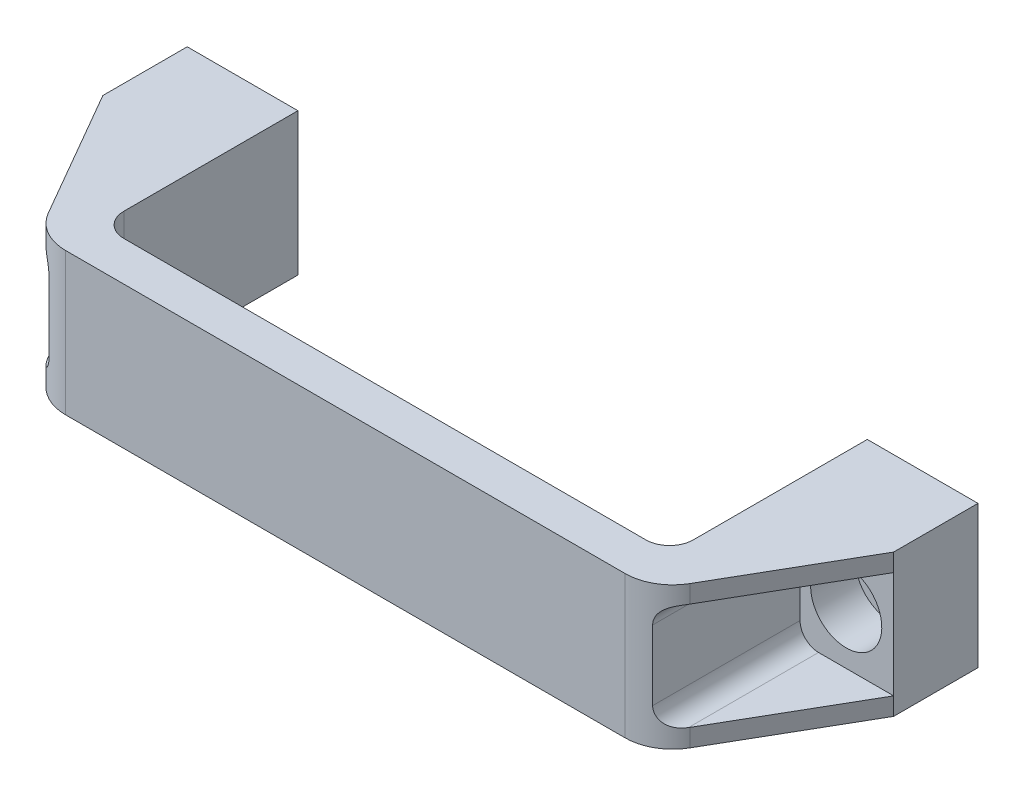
ISO-10303-21;
HEADER;
FILE_DESCRIPTION(('STEP AP214'),'2;1');
FILE_NAME('part.step','',(''),(''),'','','');
FILE_SCHEMA(('AUTOMOTIVE_DESIGN { 1 0 10303 214 1 1 1 1 }'));
ENDSEC;
DATA;
#1=APPLICATION_CONTEXT('core data for automotive mechanical design processes');
#2=APPLICATION_PROTOCOL_DEFINITION('international standard','automotive_design',2000,#1);
#3=PRODUCT_CONTEXT('',#1,'mechanical');
#4=PRODUCT('Part','Part','',(#3));
#5=PRODUCT_RELATED_PRODUCT_CATEGORY('part','',(#4));
#6=PRODUCT_DEFINITION_FORMATION('','',#4);
#7=PRODUCT_DEFINITION_CONTEXT('part definition',#1,'design');
#8=PRODUCT_DEFINITION('design','',#6,#7);
#9=PRODUCT_DEFINITION_SHAPE('','',#8);
#10=(LENGTH_UNIT() NAMED_UNIT(*) SI_UNIT(.MILLI.,.METRE.));
#11=(NAMED_UNIT(*) PLANE_ANGLE_UNIT() SI_UNIT($,.RADIAN.));
#12=(NAMED_UNIT(*) SI_UNIT($,.STERADIAN.) SOLID_ANGLE_UNIT());
#13=UNCERTAINTY_MEASURE_WITH_UNIT(LENGTH_MEASURE(1.E-05),#10,'distance_accuracy_value','');
#14=(GEOMETRIC_REPRESENTATION_CONTEXT(3) GLOBAL_UNCERTAINTY_ASSIGNED_CONTEXT((#13)) GLOBAL_UNIT_ASSIGNED_CONTEXT((#10,
#11,#12)) REPRESENTATION_CONTEXT('',''));
#15=CARTESIAN_POINT('',(0.,0.,0.));
#16=DIRECTION('',(0.,0.,1.));
#17=DIRECTION('',(1.,0.,0.));
#18=AXIS2_PLACEMENT_3D('',#15,#16,#17);
#19=CARTESIAN_POINT('',(0.,5.5,7.5));
#20=DIRECTION('',(0.,0.,-1.));
#21=DIRECTION('',(0.,1.,0.));
#22=AXIS2_PLACEMENT_3D('',#19,#20,#21);
#23=PLANE('',#22);
#24=CARTESIAN_POINT('',(0.,0.,7.5));
#25=DIRECTION('',(0.,0.,-1.));
#26=DIRECTION('',(0.,1.,0.));
#27=AXIS2_PLACEMENT_3D('',#24,#25,#26);
#28=CIRCLE('',#27,4.25);
#29=CARTESIAN_POINT('',(0.,4.25,7.5));
#30=VERTEX_POINT('',#29);
#31=EDGE_CURVE('E156',#30,#30,#28,.T.);
#32=ORIENTED_EDGE('',*,*,#31,.T.);
#33=EDGE_LOOP('',(#32));
#34=FACE_BOUND('',#33,.T.);
#35=CARTESIAN_POINT('',(0.,0.,7.5));
#36=DIRECTION('',(0.,0.,-1.));
#37=DIRECTION('',(0.,1.,0.));
#38=AXIS2_PLACEMENT_3D('',#35,#36,#37);
#39=CIRCLE('',#38,6.75);
#40=CARTESIAN_POINT('',(0.,6.75,7.5));
#41=VERTEX_POINT('',#40);
#42=EDGE_CURVE('E17',#41,#41,#39,.F.);
#43=ORIENTED_EDGE('',*,*,#42,.T.);
#44=EDGE_LOOP('',(#43));
#45=FACE_BOUND('',#44,.T.);
#46=ADVANCED_FACE('F14',(#34,#45),#23,.F.);
#47=CARTESIAN_POINT('',(132.,5.5,7.5));
#48=DIRECTION('',(0.,0.,-1.));
#49=DIRECTION('',(0.,1.,0.));
#50=AXIS2_PLACEMENT_3D('',#47,#48,#49);
#51=PLANE('',#50);
#52=CARTESIAN_POINT('',(132.,0.,7.5));
#53=DIRECTION('',(0.,0.,-1.));
#54=DIRECTION('',(0.,1.,0.));
#55=AXIS2_PLACEMENT_3D('',#52,#53,#54);
#56=CIRCLE('',#55,4.25);
#57=CARTESIAN_POINT('',(132.,4.25,7.5));
#58=VERTEX_POINT('',#57);
#59=EDGE_CURVE('E403',#58,#58,#56,.T.);
#60=ORIENTED_EDGE('',*,*,#59,.T.);
#61=EDGE_LOOP('',(#60));
#62=FACE_BOUND('',#61,.T.);
#63=CARTESIAN_POINT('',(132.,0.,7.5));
#64=DIRECTION('',(0.,0.,-1.));
#65=DIRECTION('',(0.,1.,0.));
#66=AXIS2_PLACEMENT_3D('',#63,#64,#65);
#67=CIRCLE('',#66,6.75);
#68=CARTESIAN_POINT('',(132.,6.75,7.5));
#69=VERTEX_POINT('',#68);
#70=EDGE_CURVE('E157',#69,#69,#67,.F.);
#71=ORIENTED_EDGE('',*,*,#70,.T.);
#72=EDGE_LOOP('',(#71));
#73=FACE_BOUND('',#72,.T.);
#74=ADVANCED_FACE('F421',(#62,#73),#51,.F.);
#75=CARTESIAN_POINT('',(0.,0.,11.75));
#76=DIRECTION('',(0.,0.,-1.));
#77=DIRECTION('',(0.,1.,0.));
#78=AXIS2_PLACEMENT_3D('',#75,#76,#77);
#79=CYLINDRICAL_SURFACE('',#78,6.75);
#80=CARTESIAN_POINT('',(0.,0.,16.));
#81=DIRECTION('',(0.,0.,-1.));
#82=DIRECTION('',(0.,1.,0.));
#83=AXIS2_PLACEMENT_3D('',#80,#81,#82);
#84=CIRCLE('',#83,6.75);
#85=CARTESIAN_POINT('',(0.,6.75,16.));
#86=VERTEX_POINT('',#85);
#87=EDGE_CURVE('E393',#86,#86,#84,.T.);
#88=ORIENTED_EDGE('',*,*,#87,.F.);
#89=EDGE_LOOP('',(#88));
#90=FACE_BOUND('',#89,.T.);
#91=ORIENTED_EDGE('',*,*,#42,.F.);
#92=EDGE_LOOP('',(#91));
#93=FACE_BOUND('',#92,.T.);
#94=ADVANCED_FACE('F418',(#90,#93),#79,.F.);
#95=CARTESIAN_POINT('',(132.,0.,11.75));
#96=DIRECTION('',(0.,0.,-1.));
#97=DIRECTION('',(0.,1.,0.));
#98=AXIS2_PLACEMENT_3D('',#95,#96,#97);
#99=CYLINDRICAL_SURFACE('',#98,6.75);
#100=CARTESIAN_POINT('',(132.,0.,16.));
#101=DIRECTION('',(0.,0.,-1.));
#102=DIRECTION('',(0.,1.,0.));
#103=AXIS2_PLACEMENT_3D('',#100,#101,#102);
#104=CIRCLE('',#103,6.75);
#105=CARTESIAN_POINT('',(132.,6.75,16.));
#106=VERTEX_POINT('',#105);
#107=EDGE_CURVE('E382',#106,#106,#104,.T.);
#108=ORIENTED_EDGE('',*,*,#107,.F.);
#109=EDGE_LOOP('',(#108));
#110=FACE_BOUND('',#109,.T.);
#111=ORIENTED_EDGE('',*,*,#70,.F.);
#112=EDGE_LOOP('',(#111));
#113=FACE_BOUND('',#112,.T.);
#114=ADVANCED_FACE('F420',(#110,#113),#99,.F.);
#115=CARTESIAN_POINT('',(-11.,10.125,16.));
#116=DIRECTION('',(0.,1.,0.));
#117=DIRECTION('',(-1.,0.,0.));
#118=AXIS2_PLACEMENT_3D('',#115,#116,#117);
#119=PLANE('',#118);
#120=DIRECTION('',(1.,0.,0.));
#121=VECTOR('',#120,1.);
#122=CARTESIAN_POINT('',(66.,10.125,16.));
#123=LINE('',#122,#121);
#124=CARTESIAN_POINT('',(5.25,10.125,16.));
#125=VERTEX_POINT('',#124);
#126=CARTESIAN_POINT('',(-9.,10.125,16.));
#127=VERTEX_POINT('',#126);
#128=EDGE_CURVE('E163',#125,#127,#123,.F.);
#129=ORIENTED_EDGE('',*,*,#128,.F.);
#130=DIRECTION('',(0.,0.,-1.));
#131=VECTOR('',#130,1.);
#132=CARTESIAN_POINT('',(5.25,10.125,16.));
#133=LINE('',#132,#131);
#134=CARTESIAN_POINT('',(5.25,10.125,40.6770191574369));
#135=VERTEX_POINT('',#134);
#136=EDGE_CURVE('E160',#125,#135,#133,.F.);
#137=ORIENTED_EDGE('',*,*,#136,.T.);
#138=CARTESIAN_POINT('',(12.9393102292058,10.125,36.));
#139=DIRECTION('',(0.,-1.,0.));
#140=DIRECTION('',(1.,0.,0.));
#141=AXIS2_PLACEMENT_3D('',#138,#139,#140);
#142=CIRCLE('',#141,9.);
#143=CARTESIAN_POINT('',(5.14508159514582,10.125,40.5));
#144=VERTEX_POINT('',#143);
#145=EDGE_CURVE('E144',#144,#135,#142,.F.);
#146=ORIENTED_EDGE('',*,*,#145,.F.);
#147=DIRECTION('',(-0.5,0.,-0.866025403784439));
#148=VECTOR('',#147,1.);
#149=CARTESIAN_POINT('',(5.1450815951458,10.125,40.5));
#150=LINE('',#149,#148);
#151=EDGE_CURVE('E378',#127,#144,#150,.F.);
#152=ORIENTED_EDGE('',*,*,#151,.F.);
#153=EDGE_LOOP('',(#129,#137,#146,#152));
#154=FACE_BOUND('',#153,.T.);
#155=ADVANCED_FACE('F161',(#154),#119,.F.);
#156=CARTESIAN_POINT('',(0.,0.,3.75));
#157=DIRECTION('',(0.,0.,-1.));
#158=DIRECTION('',(0.,1.,0.));
#159=AXIS2_PLACEMENT_3D('',#156,#157,#158);
#160=CYLINDRICAL_SURFACE('',#159,4.25);
#161=CARTESIAN_POINT('',(0.,0.,0.));
#162=DIRECTION('',(0.,0.,-1.));
#163=DIRECTION('',(0.,1.,0.));
#164=AXIS2_PLACEMENT_3D('',#161,#162,#163);
#165=CIRCLE('',#164,4.25);
#166=CARTESIAN_POINT('',(0.,4.25,0.));
#167=VERTEX_POINT('',#166);
#168=EDGE_CURVE('E347',#167,#167,#165,.F.);
#169=ORIENTED_EDGE('',*,*,#168,.F.);
#170=EDGE_LOOP('',(#169));
#171=FACE_BOUND('',#170,.T.);
#172=ORIENTED_EDGE('',*,*,#31,.F.);
#173=EDGE_LOOP('',(#172));
#174=FACE_BOUND('',#173,.T.);
#175=ADVANCED_FACE('F434',(#171,#174),#160,.F.);
#176=CARTESIAN_POINT('',(132.,0.,3.75));
#177=DIRECTION('',(0.,0.,-1.));
#178=DIRECTION('',(0.,1.,0.));
#179=AXIS2_PLACEMENT_3D('',#176,#177,#178);
#180=CYLINDRICAL_SURFACE('',#179,4.25);
#181=CARTESIAN_POINT('',(132.,0.,0.));
#182=DIRECTION('',(0.,0.,-1.));
#183=DIRECTION('',(0.,1.,0.));
#184=AXIS2_PLACEMENT_3D('',#181,#182,#183);
#185=CIRCLE('',#184,4.25);
#186=CARTESIAN_POINT('',(132.,4.25,0.));
#187=VERTEX_POINT('',#186);
#188=EDGE_CURVE('E333',#187,#187,#185,.F.);
#189=ORIENTED_EDGE('',*,*,#188,.F.);
#190=EDGE_LOOP('',(#189));
#191=FACE_BOUND('',#190,.T.);
#192=ORIENTED_EDGE('',*,*,#59,.F.);
#193=EDGE_LOOP('',(#192));
#194=FACE_BOUND('',#193,.T.);
#195=ADVANCED_FACE('F437',(#191,#194),#180,.F.);
#196=CARTESIAN_POINT('',(5.25,-10.125,16.));
#197=DIRECTION('',(0.,-1.,0.));
#198=DIRECTION('',(1.,0.,0.));
#199=AXIS2_PLACEMENT_3D('',#196,#197,#198);
#200=PLANE('',#199);
#201=DIRECTION('',(0.,0.,-1.));
#202=VECTOR('',#201,1.);
#203=CARTESIAN_POINT('',(5.25,-10.125,16.));
#204=LINE('',#203,#202);
#205=CARTESIAN_POINT('',(5.25,-10.125,40.6770191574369));
#206=VERTEX_POINT('',#205);
#207=CARTESIAN_POINT('',(5.25,-10.125,16.));
#208=VERTEX_POINT('',#207);
#209=EDGE_CURVE('E357',#206,#208,#204,.T.);
#210=ORIENTED_EDGE('',*,*,#209,.T.);
#211=DIRECTION('',(1.,0.,0.));
#212=VECTOR('',#211,1.);
#213=CARTESIAN_POINT('',(66.,-10.125,16.));
#214=LINE('',#213,#212);
#215=CARTESIAN_POINT('',(-9.,-10.125,16.));
#216=VERTEX_POINT('',#215);
#217=EDGE_CURVE('E391',#216,#208,#214,.T.);
#218=ORIENTED_EDGE('',*,*,#217,.F.);
#219=DIRECTION('',(-0.5,0.,-0.866025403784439));
#220=VECTOR('',#219,1.);
#221=CARTESIAN_POINT('',(5.1450815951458,-10.125,40.5));
#222=LINE('',#221,#220);
#223=CARTESIAN_POINT('',(5.14508159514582,-10.125,40.5));
#224=VERTEX_POINT('',#223);
#225=EDGE_CURVE('E325',#224,#216,#222,.T.);
#226=ORIENTED_EDGE('',*,*,#225,.F.);
#227=CARTESIAN_POINT('',(12.9393102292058,-10.125,36.));
#228=DIRECTION('',(0.,-1.,0.));
#229=DIRECTION('',(1.,0.,0.));
#230=AXIS2_PLACEMENT_3D('',#227,#228,#229);
#231=CIRCLE('',#230,9.);
#232=EDGE_CURVE('E399',#206,#224,#231,.T.);
#233=ORIENTED_EDGE('',*,*,#232,.F.);
#234=EDGE_LOOP('',(#210,#218,#226,#233));
#235=FACE_BOUND('',#234,.T.);
#236=ADVANCED_FACE('F441',(#235),#200,.F.);
#237=CARTESIAN_POINT('',(66.,0.,16.));
#238=DIRECTION('',(0.,0.,1.));
#239=DIRECTION('',(0.,-1.,0.));
#240=AXIS2_PLACEMENT_3D('',#237,#238,#239);
#241=PLANE('',#240);
#242=CARTESIAN_POINT('',(5.25,6.625,16.));
#243=DIRECTION('',(0.,0.,-1.));
#244=DIRECTION('',(0.,1.,0.));
#245=AXIS2_PLACEMENT_3D('',#242,#243,#244);
#246=CIRCLE('',#245,3.5);
#247=CARTESIAN_POINT('',(8.75,6.625,16.));
#248=VERTEX_POINT('',#247);
#249=EDGE_CURVE('E168',#248,#125,#246,.F.);
#250=ORIENTED_EDGE('',*,*,#249,.T.);
#251=ORIENTED_EDGE('',*,*,#128,.T.);
#252=DIRECTION('',(0.,-1.,0.));
#253=VECTOR('',#252,1.);
#254=CARTESIAN_POINT('',(-9.,-13.5,16.));
#255=LINE('',#254,#253);
#256=EDGE_CURVE('E310',#216,#127,#255,.F.);
#257=ORIENTED_EDGE('',*,*,#256,.F.);
#258=ORIENTED_EDGE('',*,*,#217,.T.);
#259=CARTESIAN_POINT('',(5.25,-6.625,16.));
#260=DIRECTION('',(0.,0.,-1.));
#261=DIRECTION('',(0.,1.,0.));
#262=AXIS2_PLACEMENT_3D('',#259,#260,#261);
#263=CIRCLE('',#262,3.5);
#264=CARTESIAN_POINT('',(8.75,-6.625,16.));
#265=VERTEX_POINT('',#264);
#266=EDGE_CURVE('E356',#208,#265,#263,.F.);
#267=ORIENTED_EDGE('',*,*,#266,.T.);
#268=DIRECTION('',(0.,1.,0.));
#269=VECTOR('',#268,1.);
#270=CARTESIAN_POINT('',(8.75,6.625,16.));
#271=LINE('',#270,#269);
#272=EDGE_CURVE('E167',#265,#248,#271,.T.);
#273=ORIENTED_EDGE('',*,*,#272,.T.);
#274=EDGE_LOOP('',(#250,#251,#257,#258,#267,#273));
#275=FACE_BOUND('',#274,.T.);
#276=ORIENTED_EDGE('',*,*,#87,.T.);
#277=EDGE_LOOP('',(#276));
#278=FACE_BOUND('',#277,.T.);
#279=ADVANCED_FACE('F445',(#275,#278),#241,.T.);
#280=CARTESIAN_POINT('',(143.,-10.125,16.));
#281=DIRECTION('',(0.,-1.,0.));
#282=DIRECTION('',(1.,0.,0.));
#283=AXIS2_PLACEMENT_3D('',#280,#281,#282);
#284=PLANE('',#283);
#285=DIRECTION('',(-0.5,0.,0.866025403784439));
#286=VECTOR('',#285,1.);
#287=CARTESIAN_POINT('',(141.,-10.125,16.));
#288=LINE('',#287,#286);
#289=CARTESIAN_POINT('',(141.,-10.125,16.));
#290=VERTEX_POINT('',#289);
#291=CARTESIAN_POINT('',(126.854918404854,-10.125,40.5));
#292=VERTEX_POINT('',#291);
#293=EDGE_CURVE('E316',#290,#292,#288,.T.);
#294=ORIENTED_EDGE('',*,*,#293,.F.);
#295=DIRECTION('',(1.,0.,0.));
#296=VECTOR('',#295,1.);
#297=CARTESIAN_POINT('',(66.,-10.125,16.));
#298=LINE('',#297,#296);
#299=CARTESIAN_POINT('',(126.75,-10.125,16.));
#300=VERTEX_POINT('',#299);
#301=EDGE_CURVE('E375',#300,#290,#298,.T.);
#302=ORIENTED_EDGE('',*,*,#301,.F.);
#303=DIRECTION('',(0.,0.,-1.));
#304=VECTOR('',#303,1.);
#305=CARTESIAN_POINT('',(126.75,-10.125,16.));
#306=LINE('',#305,#304);
#307=CARTESIAN_POINT('',(126.75,-10.125,40.6770191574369));
#308=VERTEX_POINT('',#307);
#309=EDGE_CURVE('E287',#300,#308,#306,.F.);
#310=ORIENTED_EDGE('',*,*,#309,.T.);
#311=CARTESIAN_POINT('',(119.060689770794,-10.125,36.));
#312=DIRECTION('',(0.,-1.,0.));
#313=DIRECTION('',(1.,0.,0.));
#314=AXIS2_PLACEMENT_3D('',#311,#312,#313);
#315=CIRCLE('',#314,9.);
#316=EDGE_CURVE('E390',#292,#308,#315,.T.);
#317=ORIENTED_EDGE('',*,*,#316,.F.);
#318=EDGE_LOOP('',(#294,#302,#310,#317));
#319=FACE_BOUND('',#318,.T.);
#320=ADVANCED_FACE('F449',(#319),#284,.F.);
#321=CARTESIAN_POINT('',(126.75,10.125,16.));
#322=DIRECTION('',(0.,1.,0.));
#323=DIRECTION('',(-1.,0.,0.));
#324=AXIS2_PLACEMENT_3D('',#321,#322,#323);
#325=PLANE('',#324);
#326=DIRECTION('',(0.,0.,-1.));
#327=VECTOR('',#326,1.);
#328=CARTESIAN_POINT('',(126.75,10.125,16.));
#329=LINE('',#328,#327);
#330=CARTESIAN_POINT('',(126.75,10.125,40.6770191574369));
#331=VERTEX_POINT('',#330);
#332=CARTESIAN_POINT('',(126.75,10.125,16.));
#333=VERTEX_POINT('',#332);
#334=EDGE_CURVE('E281',#331,#333,#329,.T.);
#335=ORIENTED_EDGE('',*,*,#334,.T.);
#336=DIRECTION('',(1.,0.,0.));
#337=VECTOR('',#336,1.);
#338=CARTESIAN_POINT('',(66.,10.125,16.));
#339=LINE('',#338,#337);
#340=CARTESIAN_POINT('',(141.,10.125,16.));
#341=VERTEX_POINT('',#340);
#342=EDGE_CURVE('E379',#341,#333,#339,.F.);
#343=ORIENTED_EDGE('',*,*,#342,.F.);
#344=DIRECTION('',(-0.5,0.,0.866025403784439));
#345=VECTOR('',#344,1.);
#346=CARTESIAN_POINT('',(141.,10.125,16.));
#347=LINE('',#346,#345);
#348=CARTESIAN_POINT('',(126.854918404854,10.125,40.5));
#349=VERTEX_POINT('',#348);
#350=EDGE_CURVE('E299',#349,#341,#347,.F.);
#351=ORIENTED_EDGE('',*,*,#350,.F.);
#352=CARTESIAN_POINT('',(119.060689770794,10.125,36.));
#353=DIRECTION('',(0.,-1.,0.));
#354=DIRECTION('',(1.,0.,0.));
#355=AXIS2_PLACEMENT_3D('',#352,#353,#354);
#356=CIRCLE('',#355,9.);
#357=EDGE_CURVE('E548',#331,#349,#356,.F.);
#358=ORIENTED_EDGE('',*,*,#357,.F.);
#359=EDGE_LOOP('',(#335,#343,#351,#358));
#360=FACE_BOUND('',#359,.T.);
#361=ADVANCED_FACE('F452',(#360),#325,.F.);
#362=CARTESIAN_POINT('',(66.,0.,16.));
#363=DIRECTION('',(0.,0.,1.));
#364=DIRECTION('',(0.,-1.,0.));
#365=AXIS2_PLACEMENT_3D('',#362,#363,#364);
#366=PLANE('',#365);
#367=CARTESIAN_POINT('',(126.75,-6.625,16.));
#368=DIRECTION('',(0.,0.,-1.));
#369=DIRECTION('',(0.,1.,0.));
#370=AXIS2_PLACEMENT_3D('',#367,#368,#369);
#371=CIRCLE('',#370,3.5);
#372=CARTESIAN_POINT('',(123.25,-6.625,16.));
#373=VERTEX_POINT('',#372);
#374=EDGE_CURVE('E290',#373,#300,#371,.F.);
#375=ORIENTED_EDGE('',*,*,#374,.T.);
#376=ORIENTED_EDGE('',*,*,#301,.T.);
#377=DIRECTION('',(0.,1.,0.));
#378=VECTOR('',#377,1.);
#379=CARTESIAN_POINT('',(141.,-13.5,16.));
#380=LINE('',#379,#378);
#381=EDGE_CURVE('E326',#341,#290,#380,.F.);
#382=ORIENTED_EDGE('',*,*,#381,.F.);
#383=ORIENTED_EDGE('',*,*,#342,.T.);
#384=CARTESIAN_POINT('',(126.75,6.625,16.));
#385=DIRECTION('',(0.,0.,-1.));
#386=DIRECTION('',(0.,1.,0.));
#387=AXIS2_PLACEMENT_3D('',#384,#385,#386);
#388=CIRCLE('',#387,3.5);
#389=CARTESIAN_POINT('',(123.25,6.625,16.));
#390=VERTEX_POINT('',#389);
#391=EDGE_CURVE('E280',#333,#390,#388,.F.);
#392=ORIENTED_EDGE('',*,*,#391,.T.);
#393=DIRECTION('',(0.,-1.,0.));
#394=VECTOR('',#393,1.);
#395=CARTESIAN_POINT('',(123.25,-6.625,16.));
#396=LINE('',#395,#394);
#397=EDGE_CURVE('E286',#390,#373,#396,.T.);
#398=ORIENTED_EDGE('',*,*,#397,.T.);
#399=EDGE_LOOP('',(#375,#376,#382,#383,#392,#398));
#400=FACE_BOUND('',#399,.T.);
#401=ORIENTED_EDGE('',*,*,#107,.T.);
#402=EDGE_LOOP('',(#401));
#403=FACE_BOUND('',#402,.T.);
#404=ADVANCED_FACE('F456',(#400,#403),#366,.T.);
#405=CARTESIAN_POINT('',(5.1450815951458,-13.5,40.5));
#406=DIRECTION('',(-0.866025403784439,0.,0.5));
#407=DIRECTION('',(-0.5,0.,-0.866025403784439));
#408=AXIS2_PLACEMENT_3D('',#405,#406,#407);
#409=PLANE('',#408);
#410=DIRECTION('',(-0.5,0.,-0.866025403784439));
#411=VECTOR('',#410,1.);
#412=CARTESIAN_POINT('',(5.1450815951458,13.5,40.5));
#413=LINE('',#412,#411);
#414=CARTESIAN_POINT('',(5.14508159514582,13.5,40.5));
#415=VERTEX_POINT('',#414);
#416=CARTESIAN_POINT('',(-9.,13.5,16.));
#417=VERTEX_POINT('',#416);
#418=EDGE_CURVE('E262',#415,#417,#413,.T.);
#419=ORIENTED_EDGE('',*,*,#418,.T.);
#420=DIRECTION('',(0.,-1.,0.));
#421=VECTOR('',#420,1.);
#422=CARTESIAN_POINT('',(-9.,-13.5,16.));
#423=LINE('',#422,#421);
#424=EDGE_CURVE('E303',#127,#417,#423,.F.);
#425=ORIENTED_EDGE('',*,*,#424,.F.);
#426=ORIENTED_EDGE('',*,*,#151,.T.);
#427=DIRECTION('',(0.,-1.,0.));
#428=VECTOR('',#427,1.);
#429=CARTESIAN_POINT('',(5.14508159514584,-13.5,40.5));
#430=LINE('',#429,#428);
#431=EDGE_CURVE('E155',#415,#144,#430,.T.);
#432=ORIENTED_EDGE('',*,*,#431,.F.);
#433=EDGE_LOOP('',(#419,#425,#426,#432));
#434=FACE_BOUND('',#433,.T.);
#435=ADVANCED_FACE('F459',(#434),#409,.T.);
#436=CARTESIAN_POINT('',(5.25,6.625,16.));
#437=DIRECTION('',(0.,0.,-1.));
#438=DIRECTION('',(0.,1.,0.));
#439=AXIS2_PLACEMENT_3D('',#436,#437,#438);
#440=CYLINDRICAL_SURFACE('',#439,3.5);
#441=ORIENTED_EDGE('',*,*,#136,.F.);
#442=ORIENTED_EDGE('',*,*,#249,.F.);
#443=DIRECTION('',(0.,0.,1.));
#444=VECTOR('',#443,1.);
#445=CARTESIAN_POINT('',(8.75,6.625,16.));
#446=LINE('',#445,#444);
#447=CARTESIAN_POINT('',(8.75,6.625,43.9655307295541));
#448=VERTEX_POINT('',#447);
#449=EDGE_CURVE('E172',#248,#448,#446,.T.);
#450=ORIENTED_EDGE('',*,*,#449,.T.);
#451=CARTESIAN_POINT('',(5.25,10.125,40.6770191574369));
#452=CARTESIAN_POINT('',(5.3262495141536,10.1249844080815,40.8024080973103));
#453=CARTESIAN_POINT('',(5.40562218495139,10.1225060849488,40.925965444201));
#454=CARTESIAN_POINT('',(5.57029393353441,10.1112968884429,41.169053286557));
#455=CARTESIAN_POINT('',(5.65560238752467,10.1025559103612,41.2885769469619));
#456=CARTESIAN_POINT('',(5.83244272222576,10.0773623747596,41.5239779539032));
#457=CARTESIAN_POINT('',(5.92402761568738,10.0608347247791,41.6398078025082));
#458=CARTESIAN_POINT('',(6.1118645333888,10.0185895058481,41.8657940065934));
#459=CARTESIAN_POINT('',(6.20811344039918,9.99287800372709,41.9759540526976));
#460=CARTESIAN_POINT('',(6.38283068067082,9.93757546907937,42.1664779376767));
#461=CARTESIAN_POINT('',(6.46059086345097,9.91005843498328,42.2480944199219));
#462=CARTESIAN_POINT('',(6.61766220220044,9.84782994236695,42.4069675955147));
#463=CARTESIAN_POINT('',(6.69697299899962,9.81312013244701,42.4842252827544));
#464=CARTESIAN_POINT('',(6.85603775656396,9.736016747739,42.6336764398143));
#465=CARTESIAN_POINT('',(6.9357890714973,9.69365146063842,42.7058872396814));
#466=CARTESIAN_POINT('',(7.09501448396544,9.60063726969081,42.8450992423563));
#467=CARTESIAN_POINT('',(7.1744886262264,9.54998977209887,42.9121013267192));
#468=CARTESIAN_POINT('',(7.32037244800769,9.44816517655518,43.0310060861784));
#469=CARTESIAN_POINT('',(7.38697979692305,9.39816851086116,43.0836780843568));
#470=CARTESIAN_POINT('',(7.51833998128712,9.29179083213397,43.1847020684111));
#471=CARTESIAN_POINT('',(7.58309313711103,9.23541093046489,43.233054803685));
#472=CARTESIAN_POINT('',(7.70993731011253,9.11624165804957,43.3252859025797));
#473=CARTESIAN_POINT('',(7.7720266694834,9.05344837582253,43.3691615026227));
#474=CARTESIAN_POINT('',(7.8925911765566,8.92166776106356,43.4522470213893));
#475=CARTESIAN_POINT('',(7.95106792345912,8.85268320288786,43.4914590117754));
#476=CARTESIAN_POINT('',(8.06382628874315,8.70845840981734,43.5653303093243));
#477=CARTESIAN_POINT('',(8.11808686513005,8.633190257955,43.5999673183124));
#478=CARTESIAN_POINT('',(8.22125790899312,8.47712742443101,43.6644429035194));
#479=CARTESIAN_POINT('',(8.27016834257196,8.39633270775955,43.6942814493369));
#480=CARTESIAN_POINT('',(8.36186774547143,8.22977946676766,43.7491856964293));
#481=CARTESIAN_POINT('',(8.40465591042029,8.14402029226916,43.7742507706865));
#482=CARTESIAN_POINT('',(8.48341955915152,7.9682326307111,43.8196615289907));
#483=CARTESIAN_POINT('',(8.51939537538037,7.87820435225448,43.8400074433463));
#484=CARTESIAN_POINT('',(8.58399463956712,7.69456130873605,43.8760776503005));
#485=CARTESIAN_POINT('',(8.61261183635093,7.60094357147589,43.8917980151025));
#486=CARTESIAN_POINT('',(8.66200842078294,7.41102134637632,43.9186789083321));
#487=CARTESIAN_POINT('',(8.68278768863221,7.31471681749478,43.9298393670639));
#488=CARTESIAN_POINT('',(8.71623315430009,7.11998206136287,43.9477042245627));
#489=CARTESIAN_POINT('',(8.72887320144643,7.02154602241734,43.9543942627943));
#490=CARTESIAN_POINT('',(8.74576893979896,6.82374131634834,43.9633049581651));
#491=CARTESIAN_POINT('',(8.75002330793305,6.72437250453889,43.9655249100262));
#492=CARTESIAN_POINT('',(8.75,6.625,43.9655307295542));
#493=B_SPLINE_CURVE_WITH_KNOTS('',3,(#451,#452,#453,#454,#455,#456,#457,#458,#459,#460,#461,
#462,#463,#464,#465,#466,#467,#468,#469,#470,#471,#472,#473,#474,#475,#476,#477,#478,#479,#480,
#481,#482,#483,#484,#485,#486,#487,#488,#489,#490,#491,#492),.UNSPECIFIED.,.F.,.F.,(4,2,2,2,2,2,
2,2,2,2,2,2,2,2,2,2,2,2,2,2,4),(0.,0.440281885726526,0.881275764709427,1.32661234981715,
1.77165528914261,2.11949179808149,2.46724867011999,2.81374589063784,3.1601843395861,
3.45551378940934,3.75079189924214,4.04625118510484,4.34157872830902,4.63829637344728,
4.93501589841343,5.23177437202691,5.52851835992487,5.82551360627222,6.12251339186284,
6.42046271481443,6.71845904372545),.UNSPECIFIED.);
#494=EDGE_CURVE('E152',#135,#448,#493,.T.);
#495=ORIENTED_EDGE('',*,*,#494,.F.);
#496=EDGE_LOOP('',(#441,#442,#450,#495));
#497=FACE_BOUND('',#496,.T.);
#498=ADVANCED_FACE('F170',(#497),#440,.F.);
#499=CARTESIAN_POINT('',(8.75,6.625,16.));
#500=DIRECTION('',(1.,0.,0.));
#501=DIRECTION('',(0.,1.,0.));
#502=AXIS2_PLACEMENT_3D('',#499,#500,#501);
#503=PLANE('',#502);
#504=ORIENTED_EDGE('',*,*,#449,.F.);
#505=ORIENTED_EDGE('',*,*,#272,.F.);
#506=DIRECTION('',(0.,0.,-1.));
#507=VECTOR('',#506,1.);
#508=CARTESIAN_POINT('',(8.75,-6.625,16.));
#509=LINE('',#508,#507);
#510=CARTESIAN_POINT('',(8.75,-6.625,43.9655307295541));
#511=VERTEX_POINT('',#510);
#512=EDGE_CURVE('E354',#265,#511,#509,.F.);
#513=ORIENTED_EDGE('',*,*,#512,.T.);
#514=DIRECTION('',(0.,-1.,0.));
#515=VECTOR('',#514,1.);
#516=CARTESIAN_POINT('',(8.75,-13.5,43.9655307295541));
#517=LINE('',#516,#515);
#518=EDGE_CURVE('E174',#448,#511,#517,.T.);
#519=ORIENTED_EDGE('',*,*,#518,.F.);
#520=EDGE_LOOP('',(#504,#505,#513,#519));
#521=FACE_BOUND('',#520,.T.);
#522=ADVANCED_FACE('F466',(#521),#503,.F.);
#523=CARTESIAN_POINT('',(5.25,-6.625,16.));
#524=DIRECTION('',(0.,0.,-1.));
#525=DIRECTION('',(0.,1.,0.));
#526=AXIS2_PLACEMENT_3D('',#523,#524,#525);
#527=CYLINDRICAL_SURFACE('',#526,3.5);
#528=ORIENTED_EDGE('',*,*,#512,.F.);
#529=ORIENTED_EDGE('',*,*,#266,.F.);
#530=ORIENTED_EDGE('',*,*,#209,.F.);
#531=CARTESIAN_POINT('',(8.75,-6.625,43.9655307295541));
#532=CARTESIAN_POINT('',(8.75001434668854,-6.71304287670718,43.9655270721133));
#533=CARTESIAN_POINT('',(8.74667851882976,-6.80108371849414,43.9637835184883));
#534=CARTESIAN_POINT('',(8.73341000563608,-6.9765185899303,43.9567900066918));
#535=CARTESIAN_POINT('',(8.72347794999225,-7.06391268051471,43.9515403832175));
#536=CARTESIAN_POINT('',(8.6971440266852,-7.23727305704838,43.9375206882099));
#537=CARTESIAN_POINT('',(8.68075377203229,-7.32324161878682,43.9287569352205));
#538=CARTESIAN_POINT('',(8.64170627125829,-7.49329563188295,43.9076605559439));
#539=CARTESIAN_POINT('',(8.61904907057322,-7.57738109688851,43.8953279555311));
#540=CARTESIAN_POINT('',(8.56774054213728,-7.74308857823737,43.8670347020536));
#541=CARTESIAN_POINT('',(8.53908838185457,-7.82471025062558,43.8510735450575));
#542=CARTESIAN_POINT('',(8.47613617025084,-7.984947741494,43.8154580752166));
#543=CARTESIAN_POINT('',(8.44183404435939,-8.06356244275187,43.7958024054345));
#544=CARTESIAN_POINT('',(8.36803851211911,-8.21719791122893,43.7527605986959));
#545=CARTESIAN_POINT('',(8.32854787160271,-8.29222056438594,43.729376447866));
#546=CARTESIAN_POINT('',(8.24484339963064,-8.43828492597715,43.6788262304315));
#547=CARTESIAN_POINT('',(8.20062781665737,-8.50932514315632,43.651658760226));
#548=CARTESIAN_POINT('',(8.10746245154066,-8.64785906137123,43.5931748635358));
#549=CARTESIAN_POINT('',(8.05846094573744,-8.71529812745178,43.5618113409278));
#550=CARTESIAN_POINT('',(7.95680923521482,-8.84536247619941,43.4952242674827));
#551=CARTESIAN_POINT('',(7.90415772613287,-8.90798602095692,43.4599993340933));
#552=CARTESIAN_POINT('',(7.74170842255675,-9.08822618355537,43.3486120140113));
#553=CARTESIAN_POINT('',(7.62734860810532,-9.1983104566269,43.2666959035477));
#554=CARTESIAN_POINT('',(7.38340570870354,-9.40456043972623,43.0821575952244));
#555=CARTESIAN_POINT('',(7.25331924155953,-9.49915691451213,42.9784702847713));
#556=CARTESIAN_POINT('',(6.99103382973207,-9.66521711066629,42.7562966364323));
#557=CARTESIAN_POINT('',(6.85883375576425,-9.73666800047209,42.6378021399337));
#558=CARTESIAN_POINT('',(6.6290237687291,-9.84372995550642,42.4186482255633));
#559=CARTESIAN_POINT('',(6.53085136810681,-9.8838322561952,42.3207008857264));
#560=CARTESIAN_POINT('',(6.33736743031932,-9.95339323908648,42.118328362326));
#561=CARTESIAN_POINT('',(6.2420573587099,-9.98284655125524,42.013899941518));
#562=CARTESIAN_POINT('',(6.05531596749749,-10.0324656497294,41.7992167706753));
#563=CARTESIAN_POINT('',(5.96389207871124,-10.052614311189,41.6889516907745));
#564=CARTESIAN_POINT('',(5.78593441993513,-10.0849058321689,41.463500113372));
#565=CARTESIAN_POINT('',(5.69939901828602,-10.0970513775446,41.3483152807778));
#566=CARTESIAN_POINT('',(5.5512042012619,-10.112616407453,41.140832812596));
#567=CARTESIAN_POINT('',(5.48843059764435,-10.1174064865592,41.0494237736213));
#568=CARTESIAN_POINT('',(5.36653211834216,-10.1235878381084,40.8646928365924));
#569=CARTESIAN_POINT('',(5.30739178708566,-10.1249946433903,40.7713816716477));
#570=CARTESIAN_POINT('',(5.25,-10.125,40.6770191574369));
#571=B_SPLINE_CURVE_WITH_KNOTS('',3,(#531,#532,#533,#534,#535,#536,#537,#538,#539,#540,#541,
#542,#543,#544,#545,#546,#547,#548,#549,#550,#551,#552,#553,#554,#555,#556,#557,#558,#559,#560,
#561,#562,#563,#564,#565,#566,#567,#568,#569,#570),.UNSPECIFIED.,.F.,.F.,(4,2,2,2,2,2,2,2,2,2,2,
2,2,2,2,2,2,2,2,4),(0.,0.264045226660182,0.528065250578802,0.791612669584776,1.05515817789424,
1.31874030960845,1.58241944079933,1.84595857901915,2.10959575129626,2.37648885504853,
2.64347783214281,3.17708240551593,3.74904234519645,4.3213188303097,4.75382901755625,
5.18655700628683,5.62007827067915,6.0534539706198,6.38630469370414,6.71762433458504),.UNSPECIFIED.);
#572=EDGE_CURVE('E176',#511,#206,#571,.T.);
#573=ORIENTED_EDGE('',*,*,#572,.F.);
#574=EDGE_LOOP('',(#528,#529,#530,#573));
#575=FACE_BOUND('',#574,.T.);
#576=ADVANCED_FACE('F612',(#575),#527,.F.);
#577=CARTESIAN_POINT('',(-9.,-13.5,0.));
#578=DIRECTION('',(0.,0.,-1.));
#579=DIRECTION('',(0.,1.,0.));
#580=AXIS2_PLACEMENT_3D('',#577,#578,#579);
#581=PLANE('',#580);
#582=DIRECTION('',(1.,0.,0.));
#583=VECTOR('',#582,1.);
#584=CARTESIAN_POINT('',(66.,-13.5,0.));
#585=LINE('',#584,#583);
#586=CARTESIAN_POINT('',(-9.,-13.5,0.));
#587=VERTEX_POINT('',#586);
#588=CARTESIAN_POINT('',(12.,-13.5,0.));
#589=VERTEX_POINT('',#588);
#590=EDGE_CURVE('E348',#587,#589,#585,.T.);
#591=ORIENTED_EDGE('',*,*,#590,.F.);
#592=DIRECTION('',(0.,-1.,0.));
#593=VECTOR('',#592,1.);
#594=CARTESIAN_POINT('',(-9.,-13.5,0.));
#595=LINE('',#594,#593);
#596=CARTESIAN_POINT('',(-9.,13.5,0.));
#597=VERTEX_POINT('',#596);
#598=EDGE_CURVE('E311',#597,#587,#595,.T.);
#599=ORIENTED_EDGE('',*,*,#598,.F.);
#600=DIRECTION('',(1.,0.,0.));
#601=VECTOR('',#600,1.);
#602=CARTESIAN_POINT('',(66.,13.5,0.));
#603=LINE('',#602,#601);
#604=CARTESIAN_POINT('',(12.,13.5,0.));
#605=VERTEX_POINT('',#604);
#606=EDGE_CURVE('E261',#597,#605,#603,.T.);
#607=ORIENTED_EDGE('',*,*,#606,.T.);
#608=DIRECTION('',(0.,1.,0.));
#609=VECTOR('',#608,1.);
#610=CARTESIAN_POINT('',(12.,-13.5,0.));
#611=LINE('',#610,#609);
#612=EDGE_CURVE('E344',#589,#605,#611,.T.);
#613=ORIENTED_EDGE('',*,*,#612,.F.);
#614=EDGE_LOOP('',(#591,#599,#607,#613));
#615=FACE_BOUND('',#614,.T.);
#616=ORIENTED_EDGE('',*,*,#168,.T.);
#617=EDGE_LOOP('',(#616));
#618=FACE_BOUND('',#617,.T.);
#619=ADVANCED_FACE('F484',(#615,#618),#581,.T.);
#620=CARTESIAN_POINT('',(12.,-13.5,0.));
#621=DIRECTION('',(1.,0.,0.));
#622=DIRECTION('',(0.,1.,0.));
#623=AXIS2_PLACEMENT_3D('',#620,#621,#622);
#624=PLANE('',#623);
#625=DIRECTION('',(0.,0.,1.));
#626=VECTOR('',#625,1.);
#627=CARTESIAN_POINT('',(12.,-13.5,0.));
#628=LINE('',#627,#626);
#629=CARTESIAN_POINT('',(12.,-13.5,33.));
#630=VERTEX_POINT('',#629);
#631=EDGE_CURVE('E351',#589,#630,#628,.T.);
#632=ORIENTED_EDGE('',*,*,#631,.F.);
#633=ORIENTED_EDGE('',*,*,#612,.T.);
#634=DIRECTION('',(0.,0.,1.));
#635=VECTOR('',#634,1.);
#636=CARTESIAN_POINT('',(12.,13.5,0.));
#637=LINE('',#636,#635);
#638=CARTESIAN_POINT('',(12.,13.5,33.));
#639=VERTEX_POINT('',#638);
#640=EDGE_CURVE('E257',#605,#639,#637,.T.);
#641=ORIENTED_EDGE('',*,*,#640,.T.);
#642=DIRECTION('',(0.,-1.,0.));
#643=VECTOR('',#642,1.);
#644=CARTESIAN_POINT('',(12.,-13.5,33.));
#645=LINE('',#644,#643);
#646=EDGE_CURVE('E342',#639,#630,#645,.T.);
#647=ORIENTED_EDGE('',*,*,#646,.T.);
#648=EDGE_LOOP('',(#632,#633,#641,#647));
#649=FACE_BOUND('',#648,.T.);
#650=ADVANCED_FACE('F489',(#649),#624,.T.);
#651=CARTESIAN_POINT('',(16.5,-13.5,33.));
#652=DIRECTION('',(0.,-1.,0.));
#653=DIRECTION('',(1.,0.,0.));
#654=AXIS2_PLACEMENT_3D('',#651,#652,#653);
#655=CYLINDRICAL_SURFACE('',#654,4.5);
#656=DIRECTION('',(0.,1.,0.));
#657=VECTOR('',#656,1.);
#658=CARTESIAN_POINT('',(16.5,-13.5,37.5));
#659=LINE('',#658,#657);
#660=CARTESIAN_POINT('',(16.5,-13.5,37.5));
#661=VERTEX_POINT('',#660);
#662=CARTESIAN_POINT('',(16.5,13.5,37.5));
#663=VERTEX_POINT('',#662);
#664=EDGE_CURVE('E339',#661,#663,#659,.T.);
#665=ORIENTED_EDGE('',*,*,#664,.F.);
#666=CARTESIAN_POINT('',(16.5,-13.5,33.));
#667=DIRECTION('',(0.,-1.,0.));
#668=DIRECTION('',(1.,0.,0.));
#669=AXIS2_PLACEMENT_3D('',#666,#667,#668);
#670=CIRCLE('',#669,4.5);
#671=EDGE_CURVE('E494',#630,#661,#670,.F.);
#672=ORIENTED_EDGE('',*,*,#671,.F.);
#673=ORIENTED_EDGE('',*,*,#646,.F.);
#674=CARTESIAN_POINT('',(16.5,13.5,33.));
#675=DIRECTION('',(0.,-1.,0.));
#676=DIRECTION('',(1.,0.,0.));
#677=AXIS2_PLACEMENT_3D('',#674,#675,#676);
#678=CIRCLE('',#677,4.5);
#679=EDGE_CURVE('E276',#639,#663,#678,.F.);
#680=ORIENTED_EDGE('',*,*,#679,.T.);
#681=EDGE_LOOP('',(#665,#672,#673,#680));
#682=FACE_BOUND('',#681,.T.);
#683=ADVANCED_FACE('F596',(#682),#655,.F.);
#684=CARTESIAN_POINT('',(16.5,-13.5,37.5));
#685=DIRECTION('',(0.,0.,-1.));
#686=DIRECTION('',(0.,1.,0.));
#687=AXIS2_PLACEMENT_3D('',#684,#685,#686);
#688=PLANE('',#687);
#689=DIRECTION('',(1.,0.,0.));
#690=VECTOR('',#689,1.);
#691=CARTESIAN_POINT('',(66.,-13.5,37.5));
#692=LINE('',#691,#690);
#693=CARTESIAN_POINT('',(115.5,-13.5,37.5));
#694=VERTEX_POINT('',#693);
#695=EDGE_CURVE('E512',#661,#694,#692,.T.);
#696=ORIENTED_EDGE('',*,*,#695,.F.);
#697=ORIENTED_EDGE('',*,*,#664,.T.);
#698=DIRECTION('',(1.,0.,0.));
#699=VECTOR('',#698,1.);
#700=CARTESIAN_POINT('',(66.,13.5,37.5));
#701=LINE('',#700,#699);
#702=CARTESIAN_POINT('',(115.5,13.5,37.5));
#703=VERTEX_POINT('',#702);
#704=EDGE_CURVE('E274',#663,#703,#701,.T.);
#705=ORIENTED_EDGE('',*,*,#704,.T.);
#706=DIRECTION('',(0.,-1.,0.));
#707=VECTOR('',#706,1.);
#708=CARTESIAN_POINT('',(115.5,-13.5,37.5));
#709=LINE('',#708,#707);
#710=EDGE_CURVE('E337',#703,#694,#709,.T.);
#711=ORIENTED_EDGE('',*,*,#710,.T.);
#712=EDGE_LOOP('',(#696,#697,#705,#711));
#713=FACE_BOUND('',#712,.T.);
#714=ADVANCED_FACE('F598',(#713),#688,.T.);
#715=CARTESIAN_POINT('',(115.5,-13.5,33.));
#716=DIRECTION('',(0.,-1.,0.));
#717=DIRECTION('',(1.,0.,0.));
#718=AXIS2_PLACEMENT_3D('',#715,#716,#717);
#719=CYLINDRICAL_SURFACE('',#718,4.5);
#720=DIRECTION('',(0.,-1.,0.));
#721=VECTOR('',#720,1.);
#722=CARTESIAN_POINT('',(120.,-13.5,33.));
#723=LINE('',#722,#721);
#724=CARTESIAN_POINT('',(120.,-13.5,33.));
#725=VERTEX_POINT('',#724);
#726=CARTESIAN_POINT('',(120.,13.5,33.));
#727=VERTEX_POINT('',#726);
#728=EDGE_CURVE('E334',#725,#727,#723,.F.);
#729=ORIENTED_EDGE('',*,*,#728,.F.);
#730=CARTESIAN_POINT('',(115.5,-13.5,33.));
#731=DIRECTION('',(0.,-1.,0.));
#732=DIRECTION('',(1.,0.,0.));
#733=AXIS2_PLACEMENT_3D('',#730,#731,#732);
#734=CIRCLE('',#733,4.5);
#735=EDGE_CURVE('E511',#694,#725,#734,.F.);
#736=ORIENTED_EDGE('',*,*,#735,.F.);
#737=ORIENTED_EDGE('',*,*,#710,.F.);
#738=CARTESIAN_POINT('',(115.5,13.5,33.));
#739=DIRECTION('',(0.,-1.,0.));
#740=DIRECTION('',(1.,0.,0.));
#741=AXIS2_PLACEMENT_3D('',#738,#739,#740);
#742=CIRCLE('',#741,4.5);
#743=EDGE_CURVE('E273',#703,#727,#742,.F.);
#744=ORIENTED_EDGE('',*,*,#743,.T.);
#745=EDGE_LOOP('',(#729,#736,#737,#744));
#746=FACE_BOUND('',#745,.T.);
#747=ADVANCED_FACE('F592',(#746),#719,.F.);
#748=CARTESIAN_POINT('',(120.,-13.5,33.));
#749=DIRECTION('',(-1.,0.,0.));
#750=DIRECTION('',(0.,-1.,0.));
#751=AXIS2_PLACEMENT_3D('',#748,#749,#750);
#752=PLANE('',#751);
#753=DIRECTION('',(0.,0.,1.));
#754=VECTOR('',#753,1.);
#755=CARTESIAN_POINT('',(120.,-13.5,0.));
#756=LINE('',#755,#754);
#757=CARTESIAN_POINT('',(120.,-13.5,0.));
#758=VERTEX_POINT('',#757);
#759=EDGE_CURVE('E329',#725,#758,#756,.F.);
#760=ORIENTED_EDGE('',*,*,#759,.F.);
#761=ORIENTED_EDGE('',*,*,#728,.T.);
#762=DIRECTION('',(0.,0.,1.));
#763=VECTOR('',#762,1.);
#764=CARTESIAN_POINT('',(120.,13.5,0.));
#765=LINE('',#764,#763);
#766=CARTESIAN_POINT('',(120.,13.5,0.));
#767=VERTEX_POINT('',#766);
#768=EDGE_CURVE('E269',#727,#767,#765,.F.);
#769=ORIENTED_EDGE('',*,*,#768,.T.);
#770=DIRECTION('',(0.,1.,0.));
#771=VECTOR('',#770,1.);
#772=CARTESIAN_POINT('',(120.,-13.5,0.));
#773=LINE('',#772,#771);
#774=EDGE_CURVE('E330',#758,#767,#773,.T.);
#775=ORIENTED_EDGE('',*,*,#774,.F.);
#776=EDGE_LOOP('',(#760,#761,#769,#775));
#777=FACE_BOUND('',#776,.T.);
#778=ADVANCED_FACE('F586',(#777),#752,.T.);
#779=CARTESIAN_POINT('',(120.,-13.5,0.));
#780=DIRECTION('',(0.,0.,-1.));
#781=DIRECTION('',(0.,1.,0.));
#782=AXIS2_PLACEMENT_3D('',#779,#780,#781);
#783=PLANE('',#782);
#784=DIRECTION('',(1.,0.,0.));
#785=VECTOR('',#784,1.);
#786=CARTESIAN_POINT('',(66.,-13.5,0.));
#787=LINE('',#786,#785);
#788=CARTESIAN_POINT('',(141.,-13.5,0.));
#789=VERTEX_POINT('',#788);
#790=EDGE_CURVE('E321',#758,#789,#787,.T.);
#791=ORIENTED_EDGE('',*,*,#790,.F.);
#792=ORIENTED_EDGE('',*,*,#774,.T.);
#793=DIRECTION('',(1.,0.,0.));
#794=VECTOR('',#793,1.);
#795=CARTESIAN_POINT('',(66.,13.5,0.));
#796=LINE('',#795,#794);
#797=CARTESIAN_POINT('',(141.,13.5,0.));
#798=VERTEX_POINT('',#797);
#799=EDGE_CURVE('E272',#767,#798,#796,.T.);
#800=ORIENTED_EDGE('',*,*,#799,.T.);
#801=DIRECTION('',(0.,1.,0.));
#802=VECTOR('',#801,1.);
#803=CARTESIAN_POINT('',(141.,-13.5,0.));
#804=LINE('',#803,#802);
#805=EDGE_CURVE('E322',#789,#798,#804,.T.);
#806=ORIENTED_EDGE('',*,*,#805,.F.);
#807=EDGE_LOOP('',(#791,#792,#800,#806));
#808=FACE_BOUND('',#807,.T.);
#809=ORIENTED_EDGE('',*,*,#188,.T.);
#810=EDGE_LOOP('',(#809));
#811=FACE_BOUND('',#810,.T.);
#812=ADVANCED_FACE('F587',(#808,#811),#783,.T.);
#813=CARTESIAN_POINT('',(141.,-13.5,0.));
#814=DIRECTION('',(1.,0.,0.));
#815=DIRECTION('',(0.,1.,0.));
#816=AXIS2_PLACEMENT_3D('',#813,#814,#815);
#817=PLANE('',#816);
#818=DIRECTION('',(0.,0.,1.));
#819=VECTOR('',#818,1.);
#820=CARTESIAN_POINT('',(141.,-13.5,0.));
#821=LINE('',#820,#819);
#822=CARTESIAN_POINT('',(141.,-13.5,16.));
#823=VERTEX_POINT('',#822);
#824=EDGE_CURVE('E317',#789,#823,#821,.T.);
#825=ORIENTED_EDGE('',*,*,#824,.F.);
#826=ORIENTED_EDGE('',*,*,#805,.T.);
#827=DIRECTION('',(0.,0.,1.));
#828=VECTOR('',#827,1.);
#829=CARTESIAN_POINT('',(141.,13.5,0.));
#830=LINE('',#829,#828);
#831=CARTESIAN_POINT('',(141.,13.5,16.));
#832=VERTEX_POINT('',#831);
#833=EDGE_CURVE('E268',#798,#832,#830,.T.);
#834=ORIENTED_EDGE('',*,*,#833,.T.);
#835=DIRECTION('',(0.,-1.,0.));
#836=VECTOR('',#835,1.);
#837=CARTESIAN_POINT('',(141.,-13.5,16.));
#838=LINE('',#837,#836);
#839=EDGE_CURVE('E302',#341,#832,#838,.F.);
#840=ORIENTED_EDGE('',*,*,#839,.F.);
#841=ORIENTED_EDGE('',*,*,#381,.T.);
#842=DIRECTION('',(0.,-1.,0.));
#843=VECTOR('',#842,1.);
#844=CARTESIAN_POINT('',(141.,-13.5,16.));
#845=LINE('',#844,#843);
#846=EDGE_CURVE('E313',#823,#290,#845,.F.);
#847=ORIENTED_EDGE('',*,*,#846,.F.);
#848=EDGE_LOOP('',(#825,#826,#834,#840,#841,#847));
#849=FACE_BOUND('',#848,.T.);
#850=ADVANCED_FACE('F571',(#849),#817,.T.);
#851=CARTESIAN_POINT('',(5.1450815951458,-13.5,40.5));
#852=DIRECTION('',(-0.866025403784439,0.,0.5));
#853=DIRECTION('',(-0.5,0.,-0.866025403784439));
#854=AXIS2_PLACEMENT_3D('',#851,#852,#853);
#855=PLANE('',#854);
#856=DIRECTION('',(-0.5,0.,-0.866025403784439));
#857=VECTOR('',#856,1.);
#858=CARTESIAN_POINT('',(5.1450815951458,-13.5,40.5));
#859=LINE('',#858,#857);
#860=CARTESIAN_POINT('',(5.14508159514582,-13.5,40.5));
#861=VERTEX_POINT('',#860);
#862=CARTESIAN_POINT('',(-9.,-13.5,16.));
#863=VERTEX_POINT('',#862);
#864=EDGE_CURVE('E306',#861,#863,#859,.T.);
#865=ORIENTED_EDGE('',*,*,#864,.F.);
#866=DIRECTION('',(0.,-1.,0.));
#867=VECTOR('',#866,1.);
#868=CARTESIAN_POINT('',(5.14508159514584,-13.5,40.5));
#869=LINE('',#868,#867);
#870=EDGE_CURVE('E260',#224,#861,#869,.T.);
#871=ORIENTED_EDGE('',*,*,#870,.F.);
#872=ORIENTED_EDGE('',*,*,#225,.T.);
#873=DIRECTION('',(0.,-1.,0.));
#874=VECTOR('',#873,1.);
#875=CARTESIAN_POINT('',(-9.,-13.5,16.));
#876=LINE('',#875,#874);
#877=EDGE_CURVE('E307',#863,#216,#876,.F.);
#878=ORIENTED_EDGE('',*,*,#877,.F.);
#879=EDGE_LOOP('',(#865,#871,#872,#878));
#880=FACE_BOUND('',#879,.T.);
#881=ADVANCED_FACE('F527',(#880),#855,.T.);
#882=CARTESIAN_POINT('',(-9.,-13.5,16.));
#883=DIRECTION('',(-1.,0.,0.));
#884=DIRECTION('',(0.,-1.,0.));
#885=AXIS2_PLACEMENT_3D('',#882,#883,#884);
#886=PLANE('',#885);
#887=ORIENTED_EDGE('',*,*,#256,.T.);
#888=ORIENTED_EDGE('',*,*,#424,.T.);
#889=DIRECTION('',(0.,0.,1.));
#890=VECTOR('',#889,1.);
#891=CARTESIAN_POINT('',(-9.,13.5,0.));
#892=LINE('',#891,#890);
#893=EDGE_CURVE('E265',#417,#597,#892,.F.);
#894=ORIENTED_EDGE('',*,*,#893,.T.);
#895=ORIENTED_EDGE('',*,*,#598,.T.);
#896=DIRECTION('',(0.,0.,1.));
#897=VECTOR('',#896,1.);
#898=CARTESIAN_POINT('',(-9.,-13.5,0.));
#899=LINE('',#898,#897);
#900=EDGE_CURVE('E298',#863,#587,#899,.F.);
#901=ORIENTED_EDGE('',*,*,#900,.F.);
#902=ORIENTED_EDGE('',*,*,#877,.T.);
#903=EDGE_LOOP('',(#887,#888,#894,#895,#901,#902));
#904=FACE_BOUND('',#903,.T.);
#905=ADVANCED_FACE('F475',(#904),#886,.T.);
#906=CARTESIAN_POINT('',(141.,-13.5,16.));
#907=DIRECTION('',(0.866025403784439,0.,0.5));
#908=DIRECTION('',(-0.5,0.,0.866025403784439));
#909=AXIS2_PLACEMENT_3D('',#906,#907,#908);
#910=PLANE('',#909);
#911=DIRECTION('',(-0.5,0.,0.866025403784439));
#912=VECTOR('',#911,1.);
#913=CARTESIAN_POINT('',(141.,13.5,16.));
#914=LINE('',#913,#912);
#915=CARTESIAN_POINT('',(126.854918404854,13.5,40.5));
#916=VERTEX_POINT('',#915);
#917=EDGE_CURVE('E266',#832,#916,#914,.T.);
#918=ORIENTED_EDGE('',*,*,#917,.T.);
#919=DIRECTION('',(0.,-1.,0.));
#920=VECTOR('',#919,1.);
#921=CARTESIAN_POINT('',(126.854918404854,-13.5,40.5));
#922=LINE('',#921,#920);
#923=EDGE_CURVE('E294',#349,#916,#922,.F.);
#924=ORIENTED_EDGE('',*,*,#923,.F.);
#925=ORIENTED_EDGE('',*,*,#350,.T.);
#926=ORIENTED_EDGE('',*,*,#839,.T.);
#927=EDGE_LOOP('',(#918,#924,#925,#926));
#928=FACE_BOUND('',#927,.T.);
#929=ADVANCED_FACE('F565',(#928),#910,.T.);
#930=CARTESIAN_POINT('',(141.,-13.5,16.));
#931=DIRECTION('',(0.866025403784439,0.,0.5));
#932=DIRECTION('',(-0.5,0.,0.866025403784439));
#933=AXIS2_PLACEMENT_3D('',#930,#931,#932);
#934=PLANE('',#933);
#935=DIRECTION('',(-0.5,0.,0.866025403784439));
#936=VECTOR('',#935,1.);
#937=CARTESIAN_POINT('',(141.,-13.5,16.));
#938=LINE('',#937,#936);
#939=CARTESIAN_POINT('',(126.854918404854,-13.5,40.5));
#940=VERTEX_POINT('',#939);
#941=EDGE_CURVE('E320',#823,#940,#938,.T.);
#942=ORIENTED_EDGE('',*,*,#941,.F.);
#943=ORIENTED_EDGE('',*,*,#846,.T.);
#944=ORIENTED_EDGE('',*,*,#293,.T.);
#945=DIRECTION('',(0.,-1.,0.));
#946=VECTOR('',#945,1.);
#947=CARTESIAN_POINT('',(126.854918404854,-13.5,40.5));
#948=LINE('',#947,#946);
#949=EDGE_CURVE('E291',#940,#292,#948,.F.);
#950=ORIENTED_EDGE('',*,*,#949,.F.);
#951=EDGE_LOOP('',(#942,#943,#944,#950));
#952=FACE_BOUND('',#951,.T.);
#953=ADVANCED_FACE('F711',(#952),#934,.T.);
#954=CARTESIAN_POINT('',(126.75,-6.625,16.));
#955=DIRECTION('',(0.,0.,-1.));
#956=DIRECTION('',(0.,1.,0.));
#957=AXIS2_PLACEMENT_3D('',#954,#955,#956);
#958=CYLINDRICAL_SURFACE('',#957,3.5);
#959=ORIENTED_EDGE('',*,*,#309,.F.);
#960=ORIENTED_EDGE('',*,*,#374,.F.);
#961=DIRECTION('',(0.,0.,1.));
#962=VECTOR('',#961,1.);
#963=CARTESIAN_POINT('',(123.25,-6.625,16.));
#964=LINE('',#963,#962);
#965=CARTESIAN_POINT('',(123.25,-6.625,43.9655307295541));
#966=VERTEX_POINT('',#965);
#967=EDGE_CURVE('E283',#373,#966,#964,.T.);
#968=ORIENTED_EDGE('',*,*,#967,.T.);
#969=CARTESIAN_POINT('',(126.75,-10.125,40.6770191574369));
#970=CARTESIAN_POINT('',(126.673750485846,-10.1249844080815,40.8024080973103));
#971=CARTESIAN_POINT('',(126.594377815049,-10.1225060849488,40.925965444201));
#972=CARTESIAN_POINT('',(126.429706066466,-10.1112968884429,41.169053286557));
#973=CARTESIAN_POINT('',(126.344397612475,-10.1025559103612,41.2885769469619));
#974=CARTESIAN_POINT('',(126.167557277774,-10.0773623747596,41.5239779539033));
#975=CARTESIAN_POINT('',(126.075972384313,-10.0608347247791,41.6398078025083));
#976=CARTESIAN_POINT('',(125.888135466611,-10.0185895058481,41.8657940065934));
#977=CARTESIAN_POINT('',(125.791886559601,-9.9928780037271,41.9759540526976));
#978=CARTESIAN_POINT('',(125.617169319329,-9.93757546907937,42.1664779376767));
#979=CARTESIAN_POINT('',(125.539409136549,-9.91005843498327,42.248094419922));
#980=CARTESIAN_POINT('',(125.3823377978,-9.84782994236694,42.4069675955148));
#981=CARTESIAN_POINT('',(125.303027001,-9.813120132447,42.4842252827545));
#982=CARTESIAN_POINT('',(125.143962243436,-9.736016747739,42.6336764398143));
#983=CARTESIAN_POINT('',(125.064210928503,-9.69365146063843,42.7058872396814));
#984=CARTESIAN_POINT('',(124.904985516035,-9.60063726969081,42.8450992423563));
#985=CARTESIAN_POINT('',(124.825511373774,-9.54998977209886,42.9121013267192));
#986=CARTESIAN_POINT('',(124.679627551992,-9.44816517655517,43.0310060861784));
#987=CARTESIAN_POINT('',(124.613020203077,-9.39816851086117,43.0836780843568));
#988=CARTESIAN_POINT('',(124.481660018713,-9.29179083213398,43.1847020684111));
#989=CARTESIAN_POINT('',(124.416906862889,-9.23541093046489,43.233054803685));
#990=CARTESIAN_POINT('',(124.290062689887,-9.11624165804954,43.3252859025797));
#991=CARTESIAN_POINT('',(124.227973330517,-9.05344837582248,43.3691615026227));
#992=CARTESIAN_POINT('',(124.107408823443,-8.92166776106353,43.4522470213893));
#993=CARTESIAN_POINT('',(124.048932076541,-8.85268320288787,43.4914590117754));
#994=CARTESIAN_POINT('',(123.936173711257,-8.70845840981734,43.5653303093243));
#995=CARTESIAN_POINT('',(123.88191313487,-8.63319025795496,43.5999673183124));
#996=CARTESIAN_POINT('',(123.778742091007,-8.47712742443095,43.6644429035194));
#997=CARTESIAN_POINT('',(123.729831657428,-8.39633270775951,43.6942814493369));
#998=CARTESIAN_POINT('',(123.638132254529,-8.22977946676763,43.7491856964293));
#999=CARTESIAN_POINT('',(123.59534408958,-8.14402029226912,43.7742507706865));
#1000=CARTESIAN_POINT('',(123.516580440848,-7.96823263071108,43.8196615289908));
#1001=CARTESIAN_POINT('',(123.48060462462,-7.87820435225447,43.8400074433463));
#1002=CARTESIAN_POINT('',(123.416005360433,-7.69456130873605,43.8760776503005));
#1003=CARTESIAN_POINT('',(123.387388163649,-7.60094357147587,43.8917980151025));
#1004=CARTESIAN_POINT('',(123.337991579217,-7.4110213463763,43.9186789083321));
#1005=CARTESIAN_POINT('',(123.317212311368,-7.31471681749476,43.9298393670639));
#1006=CARTESIAN_POINT('',(123.2837668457,-7.11998206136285,43.9477042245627));
#1007=CARTESIAN_POINT('',(123.271126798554,-7.02154602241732,43.9543942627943));
#1008=CARTESIAN_POINT('',(123.254231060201,-6.82374131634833,43.9633049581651));
#1009=CARTESIAN_POINT('',(123.249976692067,-6.72437250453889,43.9655249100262));
#1010=CARTESIAN_POINT('',(123.25,-6.625,43.9655307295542));
#1011=B_SPLINE_CURVE_WITH_KNOTS('',3,(#969,#970,#971,#972,#973,#974,#975,#976,#977,#978,#979,
#980,#981,#982,#983,#984,#985,#986,#987,#988,#989,#990,#991,#992,#993,#994,#995,#996,#997,#998,
#999,#1000,#1001,#1002,#1003,#1004,#1005,#1006,#1007,#1008,#1009,#1010),.UNSPECIFIED.,.F.,.F.,
(4,2,2,2,2,2,2,2,2,2,2,2,2,2,2,2,2,2,2,2,4),(0.,0.440281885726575,0.88127576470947,
1.3266123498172,1.77165528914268,2.11949179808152,2.46724867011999,2.81374589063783,
3.16018433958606,3.45551378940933,3.75079189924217,4.0462511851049,4.34157872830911,
4.63829637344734,4.93501589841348,5.23177437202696,5.5285183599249,5.82551360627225,
6.12251339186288,6.42046271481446,6.71845904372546),.UNSPECIFIED.);
#1012=EDGE_CURVE('E228',#308,#966,#1011,.T.);
#1013=ORIENTED_EDGE('',*,*,#1012,.F.);
#1014=EDGE_LOOP('',(#959,#960,#968,#1013));
#1015=FACE_BOUND('',#1014,.T.);
#1016=ADVANCED_FACE('F544',(#1015),#958,.F.);
#1017=CARTESIAN_POINT('',(123.25,-6.625,16.));
#1018=DIRECTION('',(-1.,0.,0.));
#1019=DIRECTION('',(0.,-1.,0.));
#1020=AXIS2_PLACEMENT_3D('',#1017,#1018,#1019);
#1021=PLANE('',#1020);
#1022=ORIENTED_EDGE('',*,*,#967,.F.);
#1023=ORIENTED_EDGE('',*,*,#397,.F.);
#1024=DIRECTION('',(0.,0.,-1.));
#1025=VECTOR('',#1024,1.);
#1026=CARTESIAN_POINT('',(123.25,6.625,16.));
#1027=LINE('',#1026,#1025);
#1028=CARTESIAN_POINT('',(123.25,6.625,43.9655307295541));
#1029=VERTEX_POINT('',#1028);
#1030=EDGE_CURVE('E277',#390,#1029,#1027,.F.);
#1031=ORIENTED_EDGE('',*,*,#1030,.T.);
#1032=DIRECTION('',(0.,-1.,0.));
#1033=VECTOR('',#1032,1.);
#1034=CARTESIAN_POINT('',(123.25,-13.5,43.9655307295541));
#1035=LINE('',#1034,#1033);
#1036=EDGE_CURVE('E226',#966,#1029,#1035,.F.);
#1037=ORIENTED_EDGE('',*,*,#1036,.F.);
#1038=EDGE_LOOP('',(#1022,#1023,#1031,#1037));
#1039=FACE_BOUND('',#1038,.T.);
#1040=ADVANCED_FACE('F213',(#1039),#1021,.F.);
#1041=CARTESIAN_POINT('',(126.75,6.625,16.));
#1042=DIRECTION('',(0.,0.,-1.));
#1043=DIRECTION('',(0.,1.,0.));
#1044=AXIS2_PLACEMENT_3D('',#1041,#1042,#1043);
#1045=CYLINDRICAL_SURFACE('',#1044,3.5);
#1046=ORIENTED_EDGE('',*,*,#1030,.F.);
#1047=ORIENTED_EDGE('',*,*,#391,.F.);
#1048=ORIENTED_EDGE('',*,*,#334,.F.);
#1049=CARTESIAN_POINT('',(123.25,6.625,43.9655307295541));
#1050=CARTESIAN_POINT('',(123.249985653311,6.71304287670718,43.9655270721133));
#1051=CARTESIAN_POINT('',(123.25332148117,6.80108371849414,43.9637835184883));
#1052=CARTESIAN_POINT('',(123.266589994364,6.9765185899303,43.9567900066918));
#1053=CARTESIAN_POINT('',(123.276522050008,7.06391268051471,43.9515403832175));
#1054=CARTESIAN_POINT('',(123.302855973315,7.23727305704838,43.9375206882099));
#1055=CARTESIAN_POINT('',(123.319246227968,7.32324161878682,43.9287569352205));
#1056=CARTESIAN_POINT('',(123.358293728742,7.49329563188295,43.9076605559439));
#1057=CARTESIAN_POINT('',(123.380950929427,7.57738109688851,43.8953279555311));
#1058=CARTESIAN_POINT('',(123.432259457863,7.74308857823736,43.8670347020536));
#1059=CARTESIAN_POINT('',(123.460911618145,7.82471025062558,43.8510735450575));
#1060=CARTESIAN_POINT('',(123.523863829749,7.984947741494,43.8154580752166));
#1061=CARTESIAN_POINT('',(123.558165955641,8.06356244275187,43.7958024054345));
#1062=CARTESIAN_POINT('',(123.631961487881,8.21719791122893,43.7527605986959));
#1063=CARTESIAN_POINT('',(123.671452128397,8.29222056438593,43.729376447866));
#1064=CARTESIAN_POINT('',(123.755156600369,8.43828492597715,43.6788262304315));
#1065=CARTESIAN_POINT('',(123.799372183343,8.50932514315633,43.651658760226));
#1066=CARTESIAN_POINT('',(123.892537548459,8.64785906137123,43.5931748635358));
#1067=CARTESIAN_POINT('',(123.941539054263,8.71529812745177,43.5618113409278));
#1068=CARTESIAN_POINT('',(124.043190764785,8.84536247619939,43.4952242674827));
#1069=CARTESIAN_POINT('',(124.095842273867,8.90798602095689,43.4599993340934));
#1070=CARTESIAN_POINT('',(124.258291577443,9.08822618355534,43.3486120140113));
#1071=CARTESIAN_POINT('',(124.372651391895,9.1983104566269,43.2666959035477));
#1072=CARTESIAN_POINT('',(124.616594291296,9.40456043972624,43.0821575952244));
#1073=CARTESIAN_POINT('',(124.74668075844,9.49915691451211,42.9784702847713));
#1074=CARTESIAN_POINT('',(125.008966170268,9.66521711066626,42.7562966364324));
#1075=CARTESIAN_POINT('',(125.141166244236,9.73666800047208,42.6378021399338));
#1076=CARTESIAN_POINT('',(125.370976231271,9.84372995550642,42.4186482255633));
#1077=CARTESIAN_POINT('',(125.469148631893,9.8838322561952,42.3207008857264));
#1078=CARTESIAN_POINT('',(125.662632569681,9.95339323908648,42.118328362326));
#1079=CARTESIAN_POINT('',(125.75794264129,9.98284655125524,42.013899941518));
#1080=CARTESIAN_POINT('',(125.944684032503,10.0324656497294,41.7992167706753));
#1081=CARTESIAN_POINT('',(126.036107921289,10.052614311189,41.6889516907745));
#1082=CARTESIAN_POINT('',(126.214065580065,10.0849058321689,41.463500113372));
#1083=CARTESIAN_POINT('',(126.300600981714,10.0970513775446,41.3483152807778));
#1084=CARTESIAN_POINT('',(126.448795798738,10.112616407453,41.140832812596));
#1085=CARTESIAN_POINT('',(126.511569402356,10.1174064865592,41.0494237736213));
#1086=CARTESIAN_POINT('',(126.633467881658,10.1235878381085,40.8646928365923));
#1087=CARTESIAN_POINT('',(126.692608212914,10.1249946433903,40.7713816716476));
#1088=CARTESIAN_POINT('',(126.75,10.125,40.6770191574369));
#1089=B_SPLINE_CURVE_WITH_KNOTS('',3,(#1049,#1050,#1051,#1052,#1053,#1054,#1055,#1056,#1057,
#1058,#1059,#1060,#1061,#1062,#1063,#1064,#1065,#1066,#1067,#1068,#1069,#1070,#1071,#1072,#1073,
#1074,#1075,#1076,#1077,#1078,#1079,#1080,#1081,#1082,#1083,#1084,#1085,#1086,#1087,#1088),
.UNSPECIFIED.,.F.,.F.,(4,2,2,2,2,2,2,2,2,2,2,2,2,2,2,2,2,2,2,4),(0.,0.264045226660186,
0.528065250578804,0.791612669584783,1.05515817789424,1.31874030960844,1.58241944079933,
1.84595857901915,2.10959575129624,2.37648885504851,2.64347783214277,3.17708240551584,
3.7490423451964,4.32131883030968,4.75382901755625,5.18655700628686,5.62007827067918,
6.05345397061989,6.38630469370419,6.71762433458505),.UNSPECIFIED.);
#1090=EDGE_CURVE('E217',#1029,#331,#1089,.T.);
#1091=ORIENTED_EDGE('',*,*,#1090,.F.);
#1092=EDGE_LOOP('',(#1046,#1047,#1048,#1091));
#1093=FACE_BOUND('',#1092,.T.);
#1094=ADVANCED_FACE('F208',(#1093),#1045,.F.);
#1095=CARTESIAN_POINT('',(66.,13.5,0.));
#1096=DIRECTION('',(0.,-1.,0.));
#1097=DIRECTION('',(1.,0.,0.));
#1098=AXIS2_PLACEMENT_3D('',#1095,#1096,#1097);
#1099=PLANE('',#1098);
#1100=ORIENTED_EDGE('',*,*,#606,.F.);
#1101=ORIENTED_EDGE('',*,*,#893,.F.);
#1102=ORIENTED_EDGE('',*,*,#418,.F.);
#1103=CARTESIAN_POINT('',(12.9393102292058,13.5,36.));
#1104=DIRECTION('',(0.,-1.,0.));
#1105=DIRECTION('',(1.,0.,0.));
#1106=AXIS2_PLACEMENT_3D('',#1103,#1104,#1105);
#1107=CIRCLE('',#1106,9.);
#1108=CARTESIAN_POINT('',(12.9393102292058,13.5,45.));
#1109=VERTEX_POINT('',#1108);
#1110=EDGE_CURVE('E178',#1109,#415,#1107,.T.);
#1111=ORIENTED_EDGE('',*,*,#1110,.F.);
#1112=DIRECTION('',(1.,0.,0.));
#1113=VECTOR('',#1112,1.);
#1114=CARTESIAN_POINT('',(66.,13.5,45.));
#1115=LINE('',#1114,#1113);
#1116=CARTESIAN_POINT('',(119.060689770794,13.5,45.));
#1117=VERTEX_POINT('',#1116);
#1118=EDGE_CURVE('E225',#1117,#1109,#1115,.F.);
#1119=ORIENTED_EDGE('',*,*,#1118,.F.);
#1120=CARTESIAN_POINT('',(119.060689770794,13.5,36.));
#1121=DIRECTION('',(0.,-1.,0.));
#1122=DIRECTION('',(1.,0.,0.));
#1123=AXIS2_PLACEMENT_3D('',#1120,#1121,#1122);
#1124=CIRCLE('',#1123,9.);
#1125=EDGE_CURVE('E297',#916,#1117,#1124,.T.);
#1126=ORIENTED_EDGE('',*,*,#1125,.F.);
#1127=ORIENTED_EDGE('',*,*,#917,.F.);
#1128=ORIENTED_EDGE('',*,*,#833,.F.);
#1129=ORIENTED_EDGE('',*,*,#799,.F.);
#1130=ORIENTED_EDGE('',*,*,#768,.F.);
#1131=ORIENTED_EDGE('',*,*,#743,.F.);
#1132=ORIENTED_EDGE('',*,*,#704,.F.);
#1133=ORIENTED_EDGE('',*,*,#679,.F.);
#1134=ORIENTED_EDGE('',*,*,#640,.F.);
#1135=EDGE_LOOP('',(#1100,#1101,#1102,#1111,#1119,#1126,#1127,#1128,#1129,#1130,#1131,#1132,
#1133,#1134));
#1136=FACE_BOUND('',#1135,.T.);
#1137=ADVANCED_FACE('F203',(#1136),#1099,.F.);
#1138=CARTESIAN_POINT('',(12.9393102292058,-13.5,36.));
#1139=DIRECTION('',(0.,-1.,0.));
#1140=DIRECTION('',(1.,0.,0.));
#1141=AXIS2_PLACEMENT_3D('',#1138,#1139,#1140);
#1142=CYLINDRICAL_SURFACE('',#1141,9.);
#1143=ORIENTED_EDGE('',*,*,#518,.T.);
#1144=ORIENTED_EDGE('',*,*,#572,.T.);
#1145=ORIENTED_EDGE('',*,*,#232,.T.);
#1146=ORIENTED_EDGE('',*,*,#870,.T.);
#1147=CARTESIAN_POINT('',(12.9393102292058,-13.5,36.));
#1148=DIRECTION('',(0.,-1.,0.));
#1149=DIRECTION('',(1.,0.,0.));
#1150=AXIS2_PLACEMENT_3D('',#1147,#1148,#1149);
#1151=CIRCLE('',#1150,9.);
#1152=CARTESIAN_POINT('',(12.9393102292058,-13.5,45.));
#1153=VERTEX_POINT('',#1152);
#1154=EDGE_CURVE('E501',#1153,#861,#1151,.T.);
#1155=ORIENTED_EDGE('',*,*,#1154,.F.);
#1156=DIRECTION('',(0.,-1.,0.));
#1157=VECTOR('',#1156,1.);
#1158=CARTESIAN_POINT('',(12.9393102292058,-13.5,45.));
#1159=LINE('',#1158,#1157);
#1160=EDGE_CURVE('E250',#1109,#1153,#1159,.T.);
#1161=ORIENTED_EDGE('',*,*,#1160,.F.);
#1162=ORIENTED_EDGE('',*,*,#1110,.T.);
#1163=ORIENTED_EDGE('',*,*,#431,.T.);
#1164=ORIENTED_EDGE('',*,*,#145,.T.);
#1165=ORIENTED_EDGE('',*,*,#494,.T.);
#1166=EDGE_LOOP('',(#1143,#1144,#1145,#1146,#1155,#1161,#1162,#1163,#1164,#1165));
#1167=FACE_BOUND('',#1166,.T.);
#1168=ADVANCED_FACE('F150',(#1167),#1142,.T.);
#1169=CARTESIAN_POINT('',(66.,-13.5,0.));
#1170=DIRECTION('',(0.,-1.,0.));
#1171=DIRECTION('',(1.,0.,0.));
#1172=AXIS2_PLACEMENT_3D('',#1169,#1170,#1171);
#1173=PLANE('',#1172);
#1174=ORIENTED_EDGE('',*,*,#864,.T.);
#1175=ORIENTED_EDGE('',*,*,#900,.T.);
#1176=ORIENTED_EDGE('',*,*,#590,.T.);
#1177=ORIENTED_EDGE('',*,*,#631,.T.);
#1178=ORIENTED_EDGE('',*,*,#671,.T.);
#1179=ORIENTED_EDGE('',*,*,#695,.T.);
#1180=ORIENTED_EDGE('',*,*,#735,.T.);
#1181=ORIENTED_EDGE('',*,*,#759,.T.);
#1182=ORIENTED_EDGE('',*,*,#790,.T.);
#1183=ORIENTED_EDGE('',*,*,#824,.T.);
#1184=ORIENTED_EDGE('',*,*,#941,.T.);
#1185=CARTESIAN_POINT('',(119.060689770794,-13.5,36.));
#1186=DIRECTION('',(0.,-1.,0.));
#1187=DIRECTION('',(1.,0.,0.));
#1188=AXIS2_PLACEMENT_3D('',#1185,#1186,#1187);
#1189=CIRCLE('',#1188,9.);
#1190=CARTESIAN_POINT('',(119.060689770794,-13.5,45.));
#1191=VERTEX_POINT('',#1190);
#1192=EDGE_CURVE('E32',#1191,#940,#1189,.F.);
#1193=ORIENTED_EDGE('',*,*,#1192,.F.);
#1194=DIRECTION('',(1.,0.,0.));
#1195=VECTOR('',#1194,1.);
#1196=CARTESIAN_POINT('',(66.,-13.5,45.));
#1197=LINE('',#1196,#1195);
#1198=EDGE_CURVE('E23',#1153,#1191,#1197,.T.);
#1199=ORIENTED_EDGE('',*,*,#1198,.F.);
#1200=ORIENTED_EDGE('',*,*,#1154,.T.);
#1201=EDGE_LOOP('',(#1174,#1175,#1176,#1177,#1178,#1179,#1180,#1181,#1182,#1183,#1184,#1193,
#1199,#1200));
#1202=FACE_BOUND('',#1201,.T.);
#1203=ADVANCED_FACE('F202',(#1202),#1173,.T.);
#1204=CARTESIAN_POINT('',(119.060689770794,-13.5,36.));
#1205=DIRECTION('',(0.,-1.,0.));
#1206=DIRECTION('',(1.,0.,0.));
#1207=AXIS2_PLACEMENT_3D('',#1204,#1205,#1206);
#1208=CYLINDRICAL_SURFACE('',#1207,9.);
#1209=ORIENTED_EDGE('',*,*,#1036,.T.);
#1210=ORIENTED_EDGE('',*,*,#1090,.T.);
#1211=ORIENTED_EDGE('',*,*,#357,.T.);
#1212=ORIENTED_EDGE('',*,*,#923,.T.);
#1213=ORIENTED_EDGE('',*,*,#1125,.T.);
#1214=DIRECTION('',(0.,-1.,0.));
#1215=VECTOR('',#1214,1.);
#1216=CARTESIAN_POINT('',(119.060689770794,-13.5,45.));
#1217=LINE('',#1216,#1215);
#1218=EDGE_CURVE('E9',#1191,#1117,#1217,.F.);
#1219=ORIENTED_EDGE('',*,*,#1218,.F.);
#1220=ORIENTED_EDGE('',*,*,#1192,.T.);
#1221=ORIENTED_EDGE('',*,*,#949,.T.);
#1222=ORIENTED_EDGE('',*,*,#316,.T.);
#1223=ORIENTED_EDGE('',*,*,#1012,.T.);
#1224=EDGE_LOOP('',(#1209,#1210,#1211,#1212,#1213,#1219,#1220,#1221,#1222,#1223));
#1225=FACE_BOUND('',#1224,.T.);
#1226=ADVANCED_FACE('F234',(#1225),#1208,.T.);
#1227=CARTESIAN_POINT('',(66.,-13.5,45.));
#1228=DIRECTION('',(0.,0.,1.));
#1229=DIRECTION('',(0.,-1.,0.));
#1230=AXIS2_PLACEMENT_3D('',#1227,#1228,#1229);
#1231=PLANE('',#1230);
#1232=ORIENTED_EDGE('',*,*,#1198,.T.);
#1233=ORIENTED_EDGE('',*,*,#1218,.T.);
#1234=ORIENTED_EDGE('',*,*,#1118,.T.);
#1235=ORIENTED_EDGE('',*,*,#1160,.T.);
#1236=EDGE_LOOP('',(#1232,#1233,#1234,#1235));
#1237=FACE_BOUND('',#1236,.T.);
#1238=ADVANCED_FACE('F238',(#1237),#1231,.T.);
#1239=CLOSED_SHELL('',(#46,#74,#94,#114,#155,#175,#195,#236,#279,#320,#361,#404,#435,#498,#522,
#576,#619,#650,#683,#714,#747,#778,#812,#850,#881,#905,#929,#953,#1016,#1040,#1094,#1137,#1168,
#1203,#1226,#1238));
#1240=MANIFOLD_SOLID_BREP('B1',#1239);
#1241=ADVANCED_BREP_SHAPE_REPRESENTATION('',(#18,#1240),#14);
#1242=SHAPE_DEFINITION_REPRESENTATION(#9,#1241);
ENDSEC;
END-ISO-10303-21;
